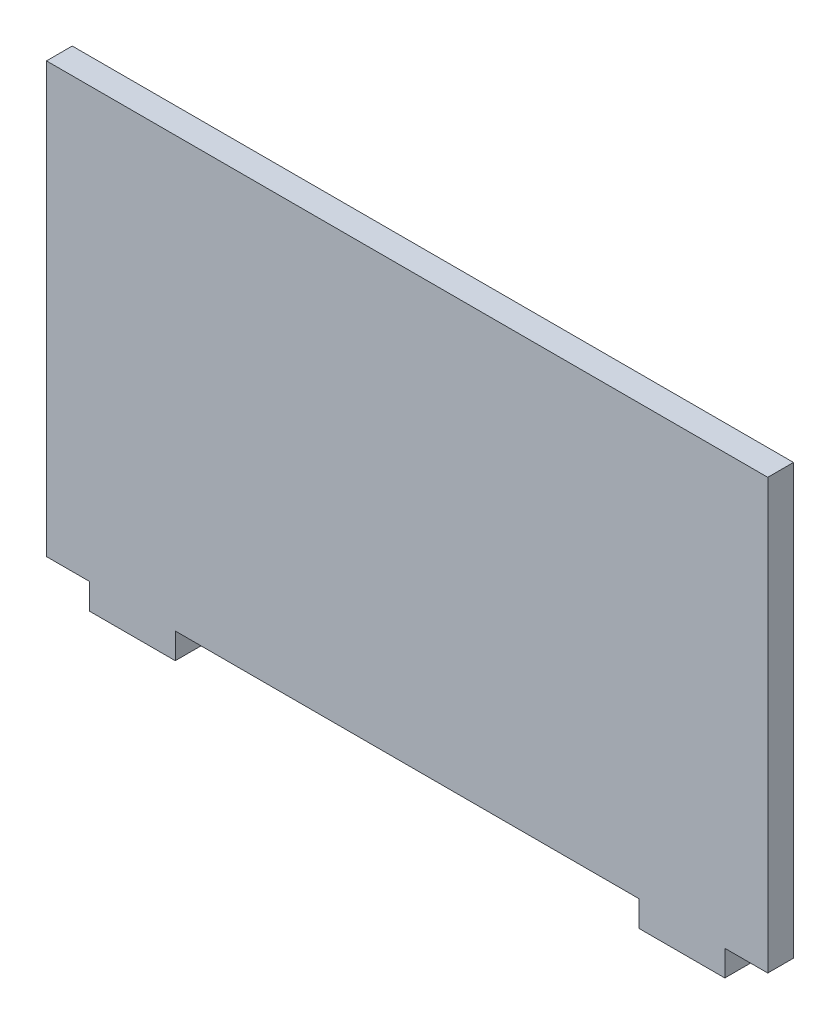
from build123d import *

# Parameters (mm, degrees)
RESSALTO_EXTRUS_O1_DEPTH = 3


with BuildPart() as part:
    # Esbo_o2 → Ressalto-extrus_o1 (new body)
    with BuildSketch(Plane.XY):
        Polygon((85.904732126, -8.971640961), (85.904732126, 41.028359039), (1.904732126, 41.028359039), (1.904732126, -8.971640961), (6.904732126, -8.971640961), (6.904732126, -11.971640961), (16.904732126, -11.971640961), (16.904732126, -8.971640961), (70.904732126, -8.971640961), (70.904732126, -11.971640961), (80.904732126, -11.971640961), (80.904732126, -8.971640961), align=None)
    extrude(amount=RESSALTO_EXTRUS_O1_DEPTH)


solid = part.part
